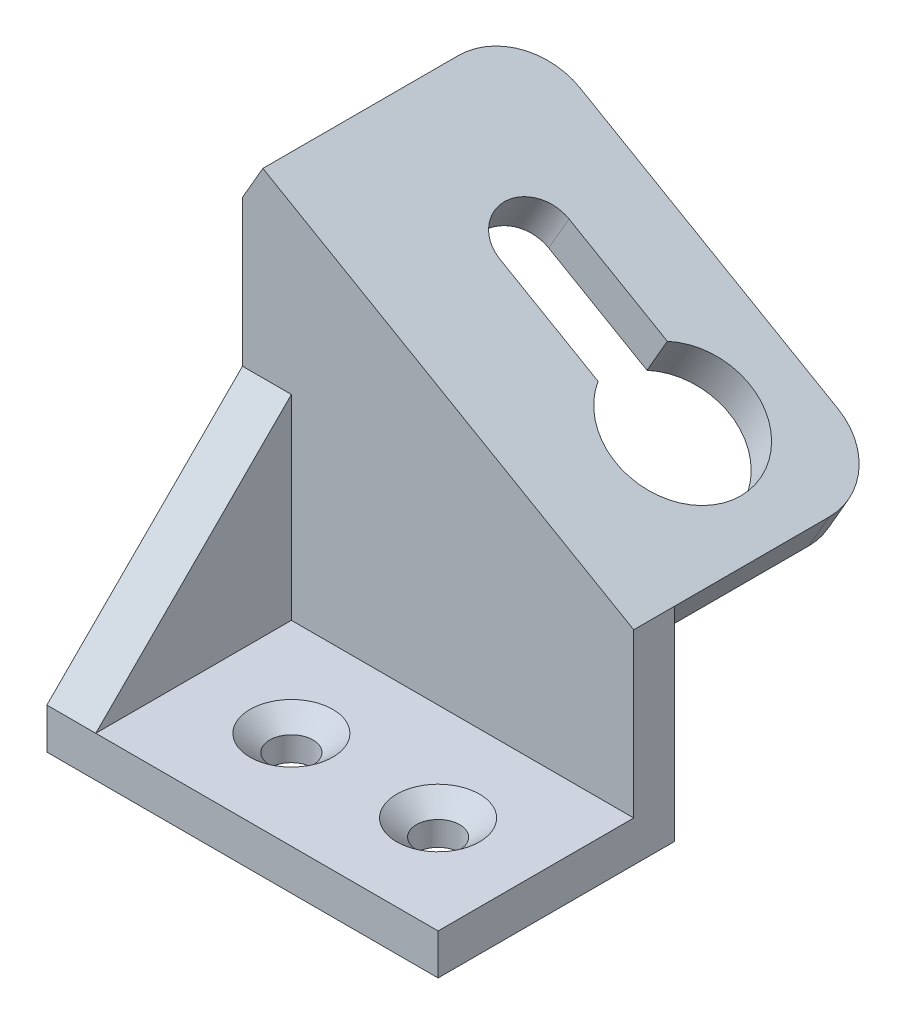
ISO-10303-21;
HEADER;
FILE_DESCRIPTION(('STEP AP214'),'2;1');
FILE_NAME('part.step','',(''),(''),'','','');
FILE_SCHEMA(('AUTOMOTIVE_DESIGN { 1 0 10303 214 1 1 1 1 }'));
ENDSEC;
DATA;
#1=APPLICATION_CONTEXT('core data for automotive mechanical design processes');
#2=APPLICATION_PROTOCOL_DEFINITION('international standard','automotive_design',2000,#1);
#3=PRODUCT_CONTEXT('',#1,'mechanical');
#4=PRODUCT('Part','Part','',(#3));
#5=PRODUCT_RELATED_PRODUCT_CATEGORY('part','',(#4));
#6=PRODUCT_DEFINITION_FORMATION('','',#4);
#7=PRODUCT_DEFINITION_CONTEXT('part definition',#1,'design');
#8=PRODUCT_DEFINITION('design','',#6,#7);
#9=PRODUCT_DEFINITION_SHAPE('','',#8);
#10=(LENGTH_UNIT() NAMED_UNIT(*) SI_UNIT(.MILLI.,.METRE.));
#11=(NAMED_UNIT(*) PLANE_ANGLE_UNIT() SI_UNIT($,.RADIAN.));
#12=(NAMED_UNIT(*) SI_UNIT($,.STERADIAN.) SOLID_ANGLE_UNIT());
#13=UNCERTAINTY_MEASURE_WITH_UNIT(LENGTH_MEASURE(1.E-05),#10,'distance_accuracy_value','');
#14=(GEOMETRIC_REPRESENTATION_CONTEXT(3) GLOBAL_UNCERTAINTY_ASSIGNED_CONTEXT((#13)) GLOBAL_UNIT_ASSIGNED_CONTEXT((#10,
#11,#12)) REPRESENTATION_CONTEXT('',''));
#15=CARTESIAN_POINT('',(0.,0.,0.));
#16=DIRECTION('',(0.,0.,1.));
#17=DIRECTION('',(1.,0.,0.));
#18=AXIS2_PLACEMENT_3D('',#15,#16,#17);
#19=CARTESIAN_POINT('',(76.2,-7.9375,0.));
#20=DIRECTION('',(0.,-1.,0.));
#21=DIRECTION('',(0.,0.,-1.));
#22=AXIS2_PLACEMENT_3D('',#19,#20,#21);
#23=PLANE('',#22);
#24=CARTESIAN_POINT('',(28.575,-7.9375,19.05));
#25=DIRECTION('',(0.,1.,0.));
#26=DIRECTION('',(0.,0.,1.));
#27=AXIS2_PLACEMENT_3D('',#24,#25,#26);
#28=CIRCLE('',#27,4.21639999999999);
#29=CARTESIAN_POINT('',(28.575,-7.9375,23.2664));
#30=VERTEX_POINT('',#29);
#31=EDGE_CURVE('E491',#30,#30,#28,.T.);
#32=ORIENTED_EDGE('',*,*,#31,.T.);
#33=EDGE_LOOP('',(#32));
#34=FACE_BOUND('',#33,.T.);
#35=DIRECTION('',(0.,0.,1.));
#36=VECTOR('',#35,1.);
#37=CARTESIAN_POINT('',(0.,-7.9375,0.));
#38=LINE('',#37,#36);
#39=CARTESIAN_POINT('',(0.,-7.9375,-7.9375));
#40=VERTEX_POINT('',#39);
#41=CARTESIAN_POINT('',(0.,-7.93749999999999,38.1));
#42=VERTEX_POINT('',#41);
#43=EDGE_CURVE('E218',#40,#42,#38,.T.);
#44=ORIENTED_EDGE('',*,*,#43,.F.);
#45=DIRECTION('',(-1.,0.,0.));
#46=VECTOR('',#45,1.);
#47=CARTESIAN_POINT('',(76.2,-7.9375,-7.9375));
#48=LINE('',#47,#46);
#49=CARTESIAN_POINT('',(76.2,-7.9375,-7.9375));
#50=VERTEX_POINT('',#49);
#51=EDGE_CURVE('E245',#50,#40,#48,.T.);
#52=ORIENTED_EDGE('',*,*,#51,.F.);
#53=DIRECTION('',(0.,0.,1.));
#54=VECTOR('',#53,1.);
#55=CARTESIAN_POINT('',(76.2,-7.9375,0.));
#56=LINE('',#55,#54);
#57=CARTESIAN_POINT('',(76.2,-7.93749999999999,38.1));
#58=VERTEX_POINT('',#57);
#59=EDGE_CURVE('E231',#50,#58,#56,.T.);
#60=ORIENTED_EDGE('',*,*,#59,.T.);
#61=DIRECTION('',(-1.,0.,0.));
#62=VECTOR('',#61,1.);
#63=CARTESIAN_POINT('',(76.2,-7.93749999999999,38.1));
#64=LINE('',#63,#62);
#65=EDGE_CURVE('E248',#58,#42,#64,.T.);
#66=ORIENTED_EDGE('',*,*,#65,.T.);
#67=EDGE_LOOP('',(#44,#52,#60,#66));
#68=FACE_BOUND('',#67,.T.);
#69=CARTESIAN_POINT('',(57.15,-7.9375,19.05));
#70=DIRECTION('',(0.,1.,0.));
#71=DIRECTION('',(0.,0.,1.));
#72=AXIS2_PLACEMENT_3D('',#69,#70,#71);
#73=CIRCLE('',#72,4.21639999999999);
#74=CARTESIAN_POINT('',(57.15,-7.9375,23.2664));
#75=VERTEX_POINT('',#74);
#76=EDGE_CURVE('E495',#75,#75,#73,.T.);
#77=ORIENTED_EDGE('',*,*,#76,.T.);
#78=EDGE_LOOP('',(#77));
#79=FACE_BOUND('',#78,.T.);
#80=ADVANCED_FACE('F28',(#34,#68,#79),#23,.T.);
#81=CARTESIAN_POINT('',(32.7981532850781,56.8080678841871,0.));
#82=DIRECTION('',(0.500000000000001,0.866025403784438,0.));
#83=DIRECTION('',(-0.866025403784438,0.500000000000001,0.));
#84=AXIS2_PLACEMENT_3D('',#81,#82,#83);
#85=PLANE('',#84);
#86=DIRECTION('',(0.866025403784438,-0.500000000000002,0.));
#87=VECTOR('',#86,1.);
#88=CARTESIAN_POINT('',(-1.17961196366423E-13,75.7440905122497,-50.8));
#89=LINE('',#88,#87);
#90=CARTESIAN_POINT('',(14.9672726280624,67.1027316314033,-50.8));
#91=VERTEX_POINT('',#90);
#92=CARTESIAN_POINT('',(65.2014773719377,38.1,-50.8));
#93=VERTEX_POINT('',#92);
#94=EDGE_CURVE('E199',#91,#93,#89,.T.);
#95=ORIENTED_EDGE('',*,*,#94,.F.);
#96=CARTESIAN_POINT('',(14.9672726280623,67.1027316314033,-38.1));
#97=DIRECTION('',(0.500000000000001,0.866025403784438,0.));
#98=DIRECTION('',(-0.866025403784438,0.500000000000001,0.));
#99=AXIS2_PLACEMENT_3D('',#96,#97,#98);
#100=CIRCLE('',#99,12.7);
#101=CARTESIAN_POINT('',(3.96874999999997,73.4527316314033,-38.1));
#102=VERTEX_POINT('',#101);
#103=EDGE_CURVE('E271',#91,#102,#100,.T.);
#104=ORIENTED_EDGE('',*,*,#103,.T.);
#105=DIRECTION('',(0.,0.,-1.));
#106=VECTOR('',#105,1.);
#107=CARTESIAN_POINT('',(3.96874999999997,73.4527316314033,0.));
#108=LINE('',#107,#106);
#109=CARTESIAN_POINT('',(3.96874999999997,73.4527316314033,0.));
#110=VERTEX_POINT('',#109);
#111=EDGE_CURVE('E193',#110,#102,#108,.T.);
#112=ORIENTED_EDGE('',*,*,#111,.F.);
#113=DIRECTION('',(0.866025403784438,-0.500000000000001,0.));
#114=VECTOR('',#113,1.);
#115=CARTESIAN_POINT('',(-26.2151226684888,90.8793986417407,0.));
#116=LINE('',#115,#114);
#117=CARTESIAN_POINT('',(76.2,31.75,0.));
#118=VERTEX_POINT('',#117);
#119=EDGE_CURVE('E213',#110,#118,#116,.T.);
#120=ORIENTED_EDGE('',*,*,#119,.T.);
#121=DIRECTION('',(0.,0.,-1.));
#122=VECTOR('',#121,1.);
#123=CARTESIAN_POINT('',(76.2,31.75,0.));
#124=LINE('',#123,#122);
#125=CARTESIAN_POINT('',(76.2,31.75,-7.9375));
#126=VERTEX_POINT('',#125);
#127=EDGE_CURVE('E237',#118,#126,#124,.T.);
#128=ORIENTED_EDGE('',*,*,#127,.T.);
#129=DIRECTION('',(0.,0.,-1.));
#130=VECTOR('',#129,1.);
#131=CARTESIAN_POINT('',(76.2,31.75,0.));
#132=LINE('',#131,#130);
#133=CARTESIAN_POINT('',(76.2000000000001,31.75,-38.1));
#134=VERTEX_POINT('',#133);
#135=EDGE_CURVE('E196',#126,#134,#132,.T.);
#136=ORIENTED_EDGE('',*,*,#135,.T.);
#137=CARTESIAN_POINT('',(65.2014773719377,38.1,-38.1));
#138=DIRECTION('',(0.500000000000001,0.866025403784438,0.));
#139=DIRECTION('',(-0.866025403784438,0.500000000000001,0.));
#140=AXIS2_PLACEMENT_3D('',#137,#138,#139);
#141=CIRCLE('',#140,12.7);
#142=EDGE_CURVE('E269',#134,#93,#141,.T.);
#143=ORIENTED_EDGE('',*,*,#142,.T.);
#144=EDGE_LOOP('',(#95,#104,#112,#120,#128,#136,#143));
#145=FACE_BOUND('',#144,.T.);
#146=DIRECTION('',(0.866025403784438,-0.500000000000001,0.));
#147=VECTOR('',#146,1.);
#148=CARTESIAN_POINT('',(28.2788781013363,59.4172726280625,-21.828125));
#149=LINE('',#148,#147);
#150=CARTESIAN_POINT('',(28.2788781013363,59.4172726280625,-21.828125));
#151=VERTEX_POINT('',#150);
#152=CARTESIAN_POINT('',(47.4285875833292,48.3611827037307,-21.828125));
#153=VERTEX_POINT('',#152);
#154=EDGE_CURVE('E162',#151,#153,#149,.T.);
#155=ORIENTED_EDGE('',*,*,#154,.F.);
#156=CARTESIAN_POINT('',(28.2788781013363,59.4172726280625,-28.575));
#157=DIRECTION('',(-0.500000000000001,-0.866025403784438,0.));
#158=DIRECTION('',(0.866025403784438,-0.500000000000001,0.));
#159=AXIS2_PLACEMENT_3D('',#156,#157,#158);
#160=CIRCLE('',#159,6.746875);
#161=CARTESIAN_POINT('',(28.2788781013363,59.4172726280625,-35.321875));
#162=VERTEX_POINT('',#161);
#163=EDGE_CURVE('E43',#151,#162,#160,.T.);
#164=ORIENTED_EDGE('',*,*,#163,.T.);
#165=DIRECTION('',(0.866025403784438,-0.500000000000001,0.));
#166=VECTOR('',#165,1.);
#167=CARTESIAN_POINT('',(28.2788781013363,59.4172726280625,-35.321875));
#168=LINE('',#167,#166);
#169=CARTESIAN_POINT('',(47.4285875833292,48.3611827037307,-35.321875));
#170=VERTEX_POINT('',#169);
#171=EDGE_CURVE('E152',#162,#170,#168,.T.);
#172=ORIENTED_EDGE('',*,*,#171,.T.);
#173=CARTESIAN_POINT('',(57.15,42.7485226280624,-28.575));
#174=DIRECTION('',(-0.500000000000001,-0.866025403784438,0.));
#175=DIRECTION('',(0.866025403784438,-0.500000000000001,0.));
#176=AXIS2_PLACEMENT_3D('',#173,#174,#175);
#177=CIRCLE('',#176,13.096875);
#178=EDGE_CURVE('E158',#170,#153,#177,.T.);
#179=ORIENTED_EDGE('',*,*,#178,.T.);
#180=EDGE_LOOP('',(#155,#164,#172,#179));
#181=FACE_BOUND('',#180,.T.);
#182=ADVANCED_FACE('F161',(#145,#181),#85,.T.);
#183=CARTESIAN_POINT('',(72.23125,24.875923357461,0.));
#184=DIRECTION('',(0.500000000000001,0.866025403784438,0.));
#185=DIRECTION('',(-0.866025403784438,0.500000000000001,0.));
#186=AXIS2_PLACEMENT_3D('',#183,#184,#185);
#187=PLANE('',#186);
#188=DIRECTION('',(0.,0.,1.));
#189=VECTOR('',#188,1.);
#190=CARTESIAN_POINT('',(0.,66.5786549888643,0.));
#191=LINE('',#190,#189);
#192=CARTESIAN_POINT('',(0.,66.5786549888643,-38.1));
#193=VERTEX_POINT('',#192);
#194=CARTESIAN_POINT('',(0.,66.5786549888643,-7.9375));
#195=VERTEX_POINT('',#194);
#196=EDGE_CURVE('E256',#193,#195,#191,.T.);
#197=ORIENTED_EDGE('',*,*,#196,.F.);
#198=CARTESIAN_POINT('',(10.9985226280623,60.2286549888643,-38.1));
#199=DIRECTION('',(0.500000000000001,0.866025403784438,0.));
#200=DIRECTION('',(-0.866025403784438,0.500000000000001,0.));
#201=AXIS2_PLACEMENT_3D('',#198,#199,#200);
#202=CIRCLE('',#201,12.7);
#203=CARTESIAN_POINT('',(10.9985226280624,60.2286549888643,-50.8));
#204=VERTEX_POINT('',#203);
#205=EDGE_CURVE('E263',#193,#204,#202,.F.);
#206=ORIENTED_EDGE('',*,*,#205,.T.);
#207=DIRECTION('',(0.866025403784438,-0.500000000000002,0.));
#208=VECTOR('',#207,1.);
#209=CARTESIAN_POINT('',(-3.96875000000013,68.8700138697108,-50.8));
#210=LINE('',#209,#208);
#211=CARTESIAN_POINT('',(61.2327273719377,31.225923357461,-50.8));
#212=VERTEX_POINT('',#211);
#213=EDGE_CURVE('E205',#204,#212,#210,.T.);
#214=ORIENTED_EDGE('',*,*,#213,.T.);
#215=CARTESIAN_POINT('',(61.2327273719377,31.225923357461,-38.1));
#216=DIRECTION('',(0.500000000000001,0.866025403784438,0.));
#217=DIRECTION('',(-0.866025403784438,0.500000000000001,0.));
#218=AXIS2_PLACEMENT_3D('',#215,#216,#217);
#219=CIRCLE('',#218,12.7);
#220=CARTESIAN_POINT('',(72.23125,24.875923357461,-38.1));
#221=VERTEX_POINT('',#220);
#222=EDGE_CURVE('E261',#212,#221,#219,.F.);
#223=ORIENTED_EDGE('',*,*,#222,.T.);
#224=DIRECTION('',(0.,0.,-1.));
#225=VECTOR('',#224,1.);
#226=CARTESIAN_POINT('',(72.23125,24.875923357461,0.));
#227=LINE('',#226,#225);
#228=CARTESIAN_POINT('',(72.23125,24.875923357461,-7.9375));
#229=VERTEX_POINT('',#228);
#230=EDGE_CURVE('E202',#229,#221,#227,.T.);
#231=ORIENTED_EDGE('',*,*,#230,.F.);
#232=DIRECTION('',(0.866025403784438,-0.500000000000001,0.));
#233=VECTOR('',#232,1.);
#234=CARTESIAN_POINT('',(85.979403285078,16.938423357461,-7.9375));
#235=LINE('',#234,#233);
#236=EDGE_CURVE('E210',#195,#229,#235,.T.);
#237=ORIENTED_EDGE('',*,*,#236,.F.);
#238=EDGE_LOOP('',(#197,#206,#214,#223,#231,#237));
#239=FACE_BOUND('',#238,.T.);
#240=CARTESIAN_POINT('',(24.3101281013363,52.5431959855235,-28.575));
#241=DIRECTION('',(0.500000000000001,0.866025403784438,0.));
#242=DIRECTION('',(-0.866025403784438,0.500000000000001,0.));
#243=AXIS2_PLACEMENT_3D('',#240,#241,#242);
#244=CIRCLE('',#243,6.746875);
#245=CARTESIAN_POINT('',(24.3101281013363,52.5431959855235,-21.828125));
#246=VERTEX_POINT('',#245);
#247=CARTESIAN_POINT('',(24.3101281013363,52.5431959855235,-35.321875));
#248=VERTEX_POINT('',#247);
#249=EDGE_CURVE('E11',#246,#248,#244,.F.);
#250=ORIENTED_EDGE('',*,*,#249,.F.);
#251=DIRECTION('',(0.866025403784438,-0.500000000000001,0.));
#252=VECTOR('',#251,1.);
#253=CARTESIAN_POINT('',(72.23125,24.875923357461,-21.828125));
#254=LINE('',#253,#252);
#255=CARTESIAN_POINT('',(43.4598375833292,41.4871060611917,-21.828125));
#256=VERTEX_POINT('',#255);
#257=EDGE_CURVE('E276',#246,#256,#254,.T.);
#258=ORIENTED_EDGE('',*,*,#257,.T.);
#259=CARTESIAN_POINT('',(53.18125,35.8744459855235,-28.575));
#260=DIRECTION('',(0.500000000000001,0.866025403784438,0.));
#261=DIRECTION('',(-0.866025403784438,0.500000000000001,0.));
#262=AXIS2_PLACEMENT_3D('',#259,#260,#261);
#263=CIRCLE('',#262,13.096875);
#264=CARTESIAN_POINT('',(43.4598375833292,41.4871060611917,-35.321875));
#265=VERTEX_POINT('',#264);
#266=EDGE_CURVE('E279',#265,#256,#263,.F.);
#267=ORIENTED_EDGE('',*,*,#266,.F.);
#268=DIRECTION('',(0.866025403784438,-0.500000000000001,0.));
#269=VECTOR('',#268,1.);
#270=CARTESIAN_POINT('',(72.23125,24.875923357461,-35.3218749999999));
#271=LINE('',#270,#269);
#272=EDGE_CURVE('E36',#248,#265,#271,.T.);
#273=ORIENTED_EDGE('',*,*,#272,.F.);
#274=EDGE_LOOP('',(#250,#258,#267,#273));
#275=FACE_BOUND('',#274,.T.);
#276=ADVANCED_FACE('F284',(#239,#275),#187,.F.);
#277=CARTESIAN_POINT('',(76.2,0.,0.));
#278=DIRECTION('',(0.,0.,-1.));
#279=DIRECTION('',(-1.,0.,0.));
#280=AXIS2_PLACEMENT_3D('',#277,#278,#279);
#281=PLANE('',#280);
#282=DIRECTION('',(0.,-1.,0.));
#283=VECTOR('',#282,1.);
#284=CARTESIAN_POINT('',(0.,0.,0.));
#285=LINE('',#284,#283);
#286=CARTESIAN_POINT('',(0.,66.5786549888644,0.));
#287=VERTEX_POINT('',#286);
#288=CARTESIAN_POINT('',(0.,38.1,0.));
#289=VERTEX_POINT('',#288);
#290=EDGE_CURVE('E223',#287,#289,#285,.T.);
#291=ORIENTED_EDGE('',*,*,#290,.T.);
#292=DIRECTION('',(-1.,0.,0.));
#293=VECTOR('',#292,1.);
#294=CARTESIAN_POINT('',(9.525,38.1,0.));
#295=LINE('',#294,#293);
#296=CARTESIAN_POINT('',(9.525,38.1,0.));
#297=VERTEX_POINT('',#296);
#298=EDGE_CURVE('E187',#297,#289,#295,.T.);
#299=ORIENTED_EDGE('',*,*,#298,.F.);
#300=DIRECTION('',(0.,-1.,0.));
#301=VECTOR('',#300,1.);
#302=CARTESIAN_POINT('',(9.525,38.1,0.));
#303=LINE('',#302,#301);
#304=CARTESIAN_POINT('',(9.525,0.,0.));
#305=VERTEX_POINT('',#304);
#306=EDGE_CURVE('E183',#297,#305,#303,.T.);
#307=ORIENTED_EDGE('',*,*,#306,.T.);
#308=DIRECTION('',(-1.,0.,0.));
#309=VECTOR('',#308,1.);
#310=CARTESIAN_POINT('',(76.2,0.,0.));
#311=LINE('',#310,#309);
#312=CARTESIAN_POINT('',(76.2,0.,0.));
#313=VERTEX_POINT('',#312);
#314=EDGE_CURVE('E242',#313,#305,#311,.T.);
#315=ORIENTED_EDGE('',*,*,#314,.F.);
#316=DIRECTION('',(0.,-1.,0.));
#317=VECTOR('',#316,1.);
#318=CARTESIAN_POINT('',(76.2,0.,0.));
#319=LINE('',#318,#317);
#320=EDGE_CURVE('E240',#118,#313,#319,.T.);
#321=ORIENTED_EDGE('',*,*,#320,.F.);
#322=ORIENTED_EDGE('',*,*,#119,.F.);
#323=DIRECTION('',(0.5,0.866025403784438,0.));
#324=VECTOR('',#323,1.);
#325=CARTESIAN_POINT('',(0.,66.5786549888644,0.));
#326=LINE('',#325,#324);
#327=EDGE_CURVE('E189',#287,#110,#326,.T.);
#328=ORIENTED_EDGE('',*,*,#327,.F.);
#329=EDGE_LOOP('',(#291,#299,#307,#315,#321,#322,#328));
#330=FACE_BOUND('',#329,.T.);
#331=ADVANCED_FACE('F356',(#330),#281,.F.);
#332=CARTESIAN_POINT('',(-3.96875000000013,68.8700138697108,-50.8));
#333=DIRECTION('',(0.,0.,1.));
#334=DIRECTION('',(1.,0.,0.));
#335=AXIS2_PLACEMENT_3D('',#332,#333,#334);
#336=PLANE('',#335);
#337=ORIENTED_EDGE('',*,*,#213,.F.);
#338=DIRECTION('',(-0.5,-0.866025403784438,0.));
#339=VECTOR('',#338,1.);
#340=CARTESIAN_POINT('',(14.9672726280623,67.1027316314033,-50.8));
#341=LINE('',#340,#339);
#342=EDGE_CURVE('E267',#204,#91,#341,.F.);
#343=ORIENTED_EDGE('',*,*,#342,.T.);
#344=ORIENTED_EDGE('',*,*,#94,.T.);
#345=DIRECTION('',(0.500000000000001,0.866025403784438,0.));
#346=VECTOR('',#345,1.);
#347=CARTESIAN_POINT('',(61.2327273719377,31.225923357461,-50.8));
#348=LINE('',#347,#346);
#349=EDGE_CURVE('E265',#93,#212,#348,.F.);
#350=ORIENTED_EDGE('',*,*,#349,.T.);
#351=EDGE_LOOP('',(#337,#343,#344,#350));
#352=FACE_BOUND('',#351,.T.);
#353=ADVANCED_FACE('F374',(#352),#336,.F.);
#354=CARTESIAN_POINT('',(0.,0.,38.1));
#355=DIRECTION('',(-1.,0.,0.));
#356=DIRECTION('',(0.,0.,1.));
#357=AXIS2_PLACEMENT_3D('',#354,#355,#356);
#358=PLANE('',#357);
#359=ORIENTED_EDGE('',*,*,#290,.F.);
#360=DIRECTION('',(0.,0.,-1.));
#361=VECTOR('',#360,1.);
#362=CARTESIAN_POINT('',(0.,66.5786549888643,38.1));
#363=LINE('',#362,#361);
#364=EDGE_CURVE('E253',#287,#195,#363,.T.);
#365=ORIENTED_EDGE('',*,*,#364,.T.);
#366=DIRECTION('',(0.,1.,0.));
#367=VECTOR('',#366,1.);
#368=CARTESIAN_POINT('',(0.,0.,-7.9375));
#369=LINE('',#368,#367);
#370=EDGE_CURVE('E221',#195,#40,#369,.F.);
#371=ORIENTED_EDGE('',*,*,#370,.T.);
#372=ORIENTED_EDGE('',*,*,#43,.T.);
#373=DIRECTION('',(0.,1.,0.));
#374=VECTOR('',#373,1.);
#375=CARTESIAN_POINT('',(0.,-7.93749999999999,38.1));
#376=LINE('',#375,#374);
#377=CARTESIAN_POINT('',(0.,0.,38.1));
#378=VERTEX_POINT('',#377);
#379=EDGE_CURVE('E215',#42,#378,#376,.T.);
#380=ORIENTED_EDGE('',*,*,#379,.T.);
#381=DIRECTION('',(0.,0.707106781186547,-0.707106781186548));
#382=VECTOR('',#381,1.);
#383=CARTESIAN_POINT('',(0.,0.,38.1));
#384=LINE('',#383,#382);
#385=EDGE_CURVE('E148',#378,#289,#384,.T.);
#386=ORIENTED_EDGE('',*,*,#385,.T.);
#387=EDGE_LOOP('',(#359,#365,#371,#372,#380,#386));
#388=FACE_BOUND('',#387,.T.);
#389=ADVANCED_FACE('F322',(#388),#358,.T.);
#390=CARTESIAN_POINT('',(76.2,0.,0.));
#391=DIRECTION('',(0.,-1.,0.));
#392=DIRECTION('',(0.,0.,-1.));
#393=AXIS2_PLACEMENT_3D('',#390,#391,#392);
#394=PLANE('',#393);
#395=CARTESIAN_POINT('',(28.575,0.,19.05));
#396=DIRECTION('',(0.,1.,0.));
#397=DIRECTION('',(0.,0.,1.));
#398=AXIS2_PLACEMENT_3D('',#395,#396,#397);
#399=CIRCLE('',#398,8.0645);
#400=CARTESIAN_POINT('',(28.575,0.,27.1145));
#401=VERTEX_POINT('',#400);
#402=EDGE_CURVE('E496',#401,#401,#399,.T.);
#403=ORIENTED_EDGE('',*,*,#402,.F.);
#404=EDGE_LOOP('',(#403));
#405=FACE_BOUND('',#404,.T.);
#406=CARTESIAN_POINT('',(57.15,0.,19.05));
#407=DIRECTION('',(0.,1.,0.));
#408=DIRECTION('',(0.,0.,1.));
#409=AXIS2_PLACEMENT_3D('',#406,#407,#408);
#410=CIRCLE('',#409,8.0645);
#411=CARTESIAN_POINT('',(57.15,0.,27.1145));
#412=VERTEX_POINT('',#411);
#413=EDGE_CURVE('E163',#412,#412,#410,.T.);
#414=ORIENTED_EDGE('',*,*,#413,.F.);
#415=EDGE_LOOP('',(#414));
#416=FACE_BOUND('',#415,.T.);
#417=ORIENTED_EDGE('',*,*,#314,.T.);
#418=DIRECTION('',(0.,0.,1.));
#419=VECTOR('',#418,1.);
#420=CARTESIAN_POINT('',(9.525,0.,0.));
#421=LINE('',#420,#419);
#422=CARTESIAN_POINT('',(9.525,0.,38.1));
#423=VERTEX_POINT('',#422);
#424=EDGE_CURVE('E178',#305,#423,#421,.T.);
#425=ORIENTED_EDGE('',*,*,#424,.T.);
#426=DIRECTION('',(-1.,0.,0.));
#427=VECTOR('',#426,1.);
#428=CARTESIAN_POINT('',(76.2,0.,38.1));
#429=LINE('',#428,#427);
#430=CARTESIAN_POINT('',(76.2,0.,38.1));
#431=VERTEX_POINT('',#430);
#432=EDGE_CURVE('E250',#431,#423,#429,.T.);
#433=ORIENTED_EDGE('',*,*,#432,.F.);
#434=DIRECTION('',(0.,0.,1.));
#435=VECTOR('',#434,1.);
#436=CARTESIAN_POINT('',(76.2,0.,0.));
#437=LINE('',#436,#435);
#438=EDGE_CURVE('E226',#313,#431,#437,.T.);
#439=ORIENTED_EDGE('',*,*,#438,.F.);
#440=EDGE_LOOP('',(#417,#425,#433,#439));
#441=FACE_BOUND('',#440,.T.);
#442=ADVANCED_FACE('F30',(#405,#416,#441),#394,.F.);
#443=CARTESIAN_POINT('',(76.2,-7.93749999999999,38.1));
#444=DIRECTION('',(0.,0.,1.));
#445=DIRECTION('',(1.,0.,0.));
#446=AXIS2_PLACEMENT_3D('',#443,#444,#445);
#447=PLANE('',#446);
#448=ORIENTED_EDGE('',*,*,#379,.F.);
#449=ORIENTED_EDGE('',*,*,#65,.F.);
#450=DIRECTION('',(0.,1.,0.));
#451=VECTOR('',#450,1.);
#452=CARTESIAN_POINT('',(76.2,-7.93749999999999,38.1));
#453=LINE('',#452,#451);
#454=EDGE_CURVE('E228',#58,#431,#453,.T.);
#455=ORIENTED_EDGE('',*,*,#454,.T.);
#456=ORIENTED_EDGE('',*,*,#432,.T.);
#457=DIRECTION('',(-1.,0.,0.));
#458=VECTOR('',#457,1.);
#459=CARTESIAN_POINT('',(9.525,0.,38.1));
#460=LINE('',#459,#458);
#461=EDGE_CURVE('E186',#423,#378,#460,.T.);
#462=ORIENTED_EDGE('',*,*,#461,.T.);
#463=EDGE_LOOP('',(#448,#449,#455,#456,#462));
#464=FACE_BOUND('',#463,.T.);
#465=ADVANCED_FACE('F312',(#464),#447,.T.);
#466=CARTESIAN_POINT('',(76.2,0.,-7.9375));
#467=DIRECTION('',(0.,0.,-1.));
#468=DIRECTION('',(-1.,0.,0.));
#469=AXIS2_PLACEMENT_3D('',#466,#467,#468);
#470=PLANE('',#469);
#471=DIRECTION('',(-0.500000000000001,-0.866025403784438,0.));
#472=VECTOR('',#471,1.);
#473=CARTESIAN_POINT('',(62.451846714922,7.93750000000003,-7.9375));
#474=LINE('',#473,#472);
#475=EDGE_CURVE('E208',#126,#229,#474,.T.);
#476=ORIENTED_EDGE('',*,*,#475,.F.);
#477=DIRECTION('',(0.,1.,0.));
#478=VECTOR('',#477,1.);
#479=CARTESIAN_POINT('',(76.2,0.,-7.9375));
#480=LINE('',#479,#478);
#481=EDGE_CURVE('E234',#126,#50,#480,.F.);
#482=ORIENTED_EDGE('',*,*,#481,.T.);
#483=ORIENTED_EDGE('',*,*,#51,.T.);
#484=ORIENTED_EDGE('',*,*,#370,.F.);
#485=ORIENTED_EDGE('',*,*,#236,.T.);
#486=EDGE_LOOP('',(#476,#482,#483,#484,#485));
#487=FACE_BOUND('',#486,.T.);
#488=ADVANCED_FACE('F310',(#487),#470,.T.);
#489=CARTESIAN_POINT('',(76.2,0.,38.1));
#490=DIRECTION('',(-1.,0.,0.));
#491=DIRECTION('',(0.,0.,1.));
#492=AXIS2_PLACEMENT_3D('',#489,#490,#491);
#493=PLANE('',#492);
#494=ORIENTED_EDGE('',*,*,#438,.T.);
#495=ORIENTED_EDGE('',*,*,#454,.F.);
#496=ORIENTED_EDGE('',*,*,#59,.F.);
#497=ORIENTED_EDGE('',*,*,#481,.F.);
#498=ORIENTED_EDGE('',*,*,#127,.F.);
#499=ORIENTED_EDGE('',*,*,#320,.T.);
#500=EDGE_LOOP('',(#494,#495,#496,#497,#498,#499));
#501=FACE_BOUND('',#500,.T.);
#502=ADVANCED_FACE('F320',(#501),#493,.F.);
#503=CARTESIAN_POINT('',(72.23125,24.875923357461,0.));
#504=DIRECTION('',(0.866025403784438,-0.500000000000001,0.));
#505=DIRECTION('',(0.500000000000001,0.866025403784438,0.));
#506=AXIS2_PLACEMENT_3D('',#503,#504,#505);
#507=PLANE('',#506);
#508=ORIENTED_EDGE('',*,*,#230,.T.);
#509=DIRECTION('',(0.500000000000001,0.866025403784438,0.));
#510=VECTOR('',#509,1.);
#511=CARTESIAN_POINT('',(76.2000000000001,31.75,-38.1));
#512=LINE('',#511,#510);
#513=EDGE_CURVE('E273',#221,#134,#512,.T.);
#514=ORIENTED_EDGE('',*,*,#513,.T.);
#515=ORIENTED_EDGE('',*,*,#135,.F.);
#516=ORIENTED_EDGE('',*,*,#475,.T.);
#517=EDGE_LOOP('',(#508,#514,#515,#516));
#518=FACE_BOUND('',#517,.T.);
#519=ADVANCED_FACE('F339',(#518),#507,.T.);
#520=CARTESIAN_POINT('',(0.,66.5786549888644,0.));
#521=DIRECTION('',(-0.866025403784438,0.5,0.));
#522=DIRECTION('',(-0.5,-0.866025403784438,0.));
#523=AXIS2_PLACEMENT_3D('',#520,#521,#522);
#524=PLANE('',#523);
#525=ORIENTED_EDGE('',*,*,#111,.T.);
#526=DIRECTION('',(-0.5,-0.866025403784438,0.));
#527=VECTOR('',#526,1.);
#528=CARTESIAN_POINT('',(0.,66.5786549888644,-38.1));
#529=LINE('',#528,#527);
#530=EDGE_CURVE('E258',#102,#193,#529,.T.);
#531=ORIENTED_EDGE('',*,*,#530,.T.);
#532=ORIENTED_EDGE('',*,*,#196,.T.);
#533=ORIENTED_EDGE('',*,*,#364,.F.);
#534=ORIENTED_EDGE('',*,*,#327,.T.);
#535=EDGE_LOOP('',(#525,#531,#532,#533,#534));
#536=FACE_BOUND('',#535,.T.);
#537=ADVANCED_FACE('F367',(#536),#524,.T.);
#538=CARTESIAN_POINT('',(10.9985226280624,60.2286549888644,-38.1));
#539=DIRECTION('',(0.5,0.866025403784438,0.));
#540=DIRECTION('',(-0.866025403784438,0.5,0.));
#541=AXIS2_PLACEMENT_3D('',#538,#539,#540);
#542=CYLINDRICAL_SURFACE('',#541,12.7);
#543=ORIENTED_EDGE('',*,*,#103,.F.);
#544=ORIENTED_EDGE('',*,*,#342,.F.);
#545=ORIENTED_EDGE('',*,*,#205,.F.);
#546=ORIENTED_EDGE('',*,*,#530,.F.);
#547=EDGE_LOOP('',(#543,#544,#545,#546));
#548=FACE_BOUND('',#547,.T.);
#549=ADVANCED_FACE('F372',(#548),#542,.T.);
#550=CARTESIAN_POINT('',(61.2327273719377,31.225923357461,-38.1));
#551=DIRECTION('',(-0.500000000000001,-0.866025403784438,0.));
#552=DIRECTION('',(0.866025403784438,-0.500000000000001,0.));
#553=AXIS2_PLACEMENT_3D('',#550,#551,#552);
#554=CYLINDRICAL_SURFACE('',#553,12.7);
#555=ORIENTED_EDGE('',*,*,#222,.F.);
#556=ORIENTED_EDGE('',*,*,#349,.F.);
#557=ORIENTED_EDGE('',*,*,#142,.F.);
#558=ORIENTED_EDGE('',*,*,#513,.F.);
#559=EDGE_LOOP('',(#555,#556,#557,#558));
#560=FACE_BOUND('',#559,.T.);
#561=ADVANCED_FACE('F347',(#560),#554,.T.);
#562=CARTESIAN_POINT('',(9.525,0.,38.1));
#563=DIRECTION('',(0.,0.707106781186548,0.707106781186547));
#564=DIRECTION('',(0.,-0.707106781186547,0.707106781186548));
#565=AXIS2_PLACEMENT_3D('',#562,#563,#564);
#566=PLANE('',#565);
#567=ORIENTED_EDGE('',*,*,#385,.F.);
#568=ORIENTED_EDGE('',*,*,#461,.F.);
#569=DIRECTION('',(0.,0.707106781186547,-0.707106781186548));
#570=VECTOR('',#569,1.);
#571=CARTESIAN_POINT('',(9.525,0.,38.1));
#572=LINE('',#571,#570);
#573=EDGE_CURVE('E181',#423,#297,#572,.T.);
#574=ORIENTED_EDGE('',*,*,#573,.T.);
#575=ORIENTED_EDGE('',*,*,#298,.T.);
#576=EDGE_LOOP('',(#567,#568,#574,#575));
#577=FACE_BOUND('',#576,.T.);
#578=ADVANCED_FACE('F364',(#577),#566,.T.);
#579=CARTESIAN_POINT('',(9.525,0.,0.));
#580=DIRECTION('',(1.,0.,0.));
#581=DIRECTION('',(0.,0.,-1.));
#582=AXIS2_PLACEMENT_3D('',#579,#580,#581);
#583=PLANE('',#582);
#584=ORIENTED_EDGE('',*,*,#424,.F.);
#585=ORIENTED_EDGE('',*,*,#306,.F.);
#586=ORIENTED_EDGE('',*,*,#573,.F.);
#587=EDGE_LOOP('',(#584,#585,#586));
#588=FACE_BOUND('',#587,.T.);
#589=ADVANCED_FACE('F362',(#588),#583,.T.);
#590=CARTESIAN_POINT('',(-7.95631350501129,-3.34392025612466,-28.575));
#591=DIRECTION('',(0.500000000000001,0.866025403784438,0.));
#592=DIRECTION('',(-0.866025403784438,0.500000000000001,0.));
#593=AXIS2_PLACEMENT_3D('',#590,#591,#592);
#594=CYLINDRICAL_SURFACE('',#593,6.746875);
#595=ORIENTED_EDGE('',*,*,#249,.T.);
#596=DIRECTION('',(0.500000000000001,0.866025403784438,0.));
#597=VECTOR('',#596,1.);
#598=CARTESIAN_POINT('',(-7.95631350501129,-3.34392025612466,-35.321875));
#599=LINE('',#598,#597);
#600=EDGE_CURVE('E142',#248,#162,#599,.T.);
#601=ORIENTED_EDGE('',*,*,#600,.T.);
#602=ORIENTED_EDGE('',*,*,#163,.F.);
#603=DIRECTION('',(0.500000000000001,0.866025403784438,0.));
#604=VECTOR('',#603,1.);
#605=CARTESIAN_POINT('',(-7.95631350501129,-3.34392025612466,-21.828125));
#606=LINE('',#605,#604);
#607=EDGE_CURVE('E172',#246,#151,#606,.T.);
#608=ORIENTED_EDGE('',*,*,#607,.F.);
#609=EDGE_LOOP('',(#595,#601,#602,#608));
#610=FACE_BOUND('',#609,.T.);
#611=ADVANCED_FACE('F144',(#610),#594,.F.);
#612=CARTESIAN_POINT('',(-7.95631350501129,-3.34392025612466,-35.321875));
#613=DIRECTION('',(0.,0.,1.));
#614=DIRECTION('',(1.,0.,0.));
#615=AXIS2_PLACEMENT_3D('',#612,#613,#614);
#616=PLANE('',#615);
#617=ORIENTED_EDGE('',*,*,#272,.T.);
#618=DIRECTION('',(0.500000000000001,0.866025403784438,0.));
#619=VECTOR('',#618,1.);
#620=CARTESIAN_POINT('',(11.1933959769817,-14.4000101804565,-35.321875));
#621=LINE('',#620,#619);
#622=EDGE_CURVE('E149',#265,#170,#621,.T.);
#623=ORIENTED_EDGE('',*,*,#622,.T.);
#624=ORIENTED_EDGE('',*,*,#171,.F.);
#625=ORIENTED_EDGE('',*,*,#600,.F.);
#626=EDGE_LOOP('',(#617,#623,#624,#625));
#627=FACE_BOUND('',#626,.T.);
#628=ADVANCED_FACE('F153',(#627),#616,.T.);
#629=CARTESIAN_POINT('',(20.9148083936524,-20.0126702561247,-28.575));
#630=DIRECTION('',(0.500000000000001,0.866025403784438,0.));
#631=DIRECTION('',(-0.866025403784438,0.500000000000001,0.));
#632=AXIS2_PLACEMENT_3D('',#629,#630,#631);
#633=CYLINDRICAL_SURFACE('',#632,13.096875);
#634=ORIENTED_EDGE('',*,*,#266,.T.);
#635=DIRECTION('',(0.500000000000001,0.866025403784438,0.));
#636=VECTOR('',#635,1.);
#637=CARTESIAN_POINT('',(11.1933959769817,-14.4000101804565,-21.828125));
#638=LINE('',#637,#636);
#639=EDGE_CURVE('E51',#256,#153,#638,.T.);
#640=ORIENTED_EDGE('',*,*,#639,.T.);
#641=ORIENTED_EDGE('',*,*,#178,.F.);
#642=ORIENTED_EDGE('',*,*,#622,.F.);
#643=EDGE_LOOP('',(#634,#640,#641,#642));
#644=FACE_BOUND('',#643,.T.);
#645=ADVANCED_FACE('F283',(#644),#633,.F.);
#646=CARTESIAN_POINT('',(-7.95631350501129,-3.34392025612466,-21.828125));
#647=DIRECTION('',(0.,0.,1.));
#648=DIRECTION('',(1.,0.,0.));
#649=AXIS2_PLACEMENT_3D('',#646,#647,#648);
#650=PLANE('',#649);
#651=ORIENTED_EDGE('',*,*,#607,.T.);
#652=ORIENTED_EDGE('',*,*,#154,.T.);
#653=ORIENTED_EDGE('',*,*,#639,.F.);
#654=ORIENTED_EDGE('',*,*,#257,.F.);
#655=EDGE_LOOP('',(#651,#652,#653,#654));
#656=FACE_BOUND('',#655,.T.);
#657=ADVANCED_FACE('F285',(#656),#650,.F.);
#658=CARTESIAN_POINT('',(57.15,0.,19.05));
#659=DIRECTION('',(0.,1.,0.));
#660=DIRECTION('',(0.,0.,1.));
#661=AXIS2_PLACEMENT_3D('',#658,#659,#660);
#662=CONICAL_SURFACE('',#661,8.0645,0.872664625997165);
#663=CARTESIAN_POINT('',(57.15,-3.22893929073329,19.05));
#664=DIRECTION('',(0.,1.,0.));
#665=DIRECTION('',(0.,0.,1.));
#666=AXIS2_PLACEMENT_3D('',#663,#664,#665);
#667=CIRCLE('',#666,4.2164);
#668=CARTESIAN_POINT('',(57.15,-3.22893929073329,23.2664));
#669=VERTEX_POINT('',#668);
#670=EDGE_CURVE('E166',#669,#669,#667,.T.);
#671=ORIENTED_EDGE('',*,*,#670,.F.);
#672=EDGE_LOOP('',(#671));
#673=FACE_BOUND('',#672,.T.);
#674=ORIENTED_EDGE('',*,*,#413,.T.);
#675=EDGE_LOOP('',(#674));
#676=FACE_BOUND('',#675,.T.);
#677=ADVANCED_FACE('F287',(#673,#676),#662,.F.);
#678=CARTESIAN_POINT('',(57.15,0.,19.05));
#679=DIRECTION('',(0.,1.,0.));
#680=DIRECTION('',(0.,0.,1.));
#681=AXIS2_PLACEMENT_3D('',#678,#679,#680);
#682=CYLINDRICAL_SURFACE('',#681,4.2164);
#683=ORIENTED_EDGE('',*,*,#76,.F.);
#684=EDGE_LOOP('',(#683));
#685=FACE_BOUND('',#684,.T.);
#686=ORIENTED_EDGE('',*,*,#670,.T.);
#687=EDGE_LOOP('',(#686));
#688=FACE_BOUND('',#687,.T.);
#689=ADVANCED_FACE('F293',(#685,#688),#682,.F.);
#690=CARTESIAN_POINT('',(28.575,0.,19.05));
#691=DIRECTION('',(0.,1.,0.));
#692=DIRECTION('',(0.,0.,1.));
#693=AXIS2_PLACEMENT_3D('',#690,#691,#692);
#694=CONICAL_SURFACE('',#693,8.0645,0.872664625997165);
#695=CARTESIAN_POINT('',(28.575,-3.22893929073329,19.05));
#696=DIRECTION('',(0.,1.,0.));
#697=DIRECTION('',(0.,0.,1.));
#698=AXIS2_PLACEMENT_3D('',#695,#696,#697);
#699=CIRCLE('',#698,4.2164);
#700=CARTESIAN_POINT('',(28.575,-3.22893929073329,23.2664));
#701=VERTEX_POINT('',#700);
#702=EDGE_CURVE('E494',#701,#701,#699,.T.);
#703=ORIENTED_EDGE('',*,*,#702,.F.);
#704=EDGE_LOOP('',(#703));
#705=FACE_BOUND('',#704,.T.);
#706=ORIENTED_EDGE('',*,*,#402,.T.);
#707=EDGE_LOOP('',(#706));
#708=FACE_BOUND('',#707,.T.);
#709=ADVANCED_FACE('F471',(#705,#708),#694,.F.);
#710=CARTESIAN_POINT('',(28.575,0.,19.05));
#711=DIRECTION('',(0.,1.,0.));
#712=DIRECTION('',(0.,0.,1.));
#713=AXIS2_PLACEMENT_3D('',#710,#711,#712);
#714=CYLINDRICAL_SURFACE('',#713,4.2164);
#715=ORIENTED_EDGE('',*,*,#31,.F.);
#716=EDGE_LOOP('',(#715));
#717=FACE_BOUND('',#716,.T.);
#718=ORIENTED_EDGE('',*,*,#702,.T.);
#719=EDGE_LOOP('',(#718));
#720=FACE_BOUND('',#719,.T.);
#721=ADVANCED_FACE('F474',(#717,#720),#714,.F.);
#722=CLOSED_SHELL('',(#80,#182,#276,#331,#353,#389,#442,#465,#488,#502,#519,#537,#549,#561,#578,
#589,#611,#628,#645,#657,#677,#689,#709,#721));
#723=MANIFOLD_SOLID_BREP('B2',#722);
#724=ADVANCED_BREP_SHAPE_REPRESENTATION('',(#18,#723),#14);
#725=SHAPE_DEFINITION_REPRESENTATION(#9,#724);
ENDSEC;
END-ISO-10303-21;
